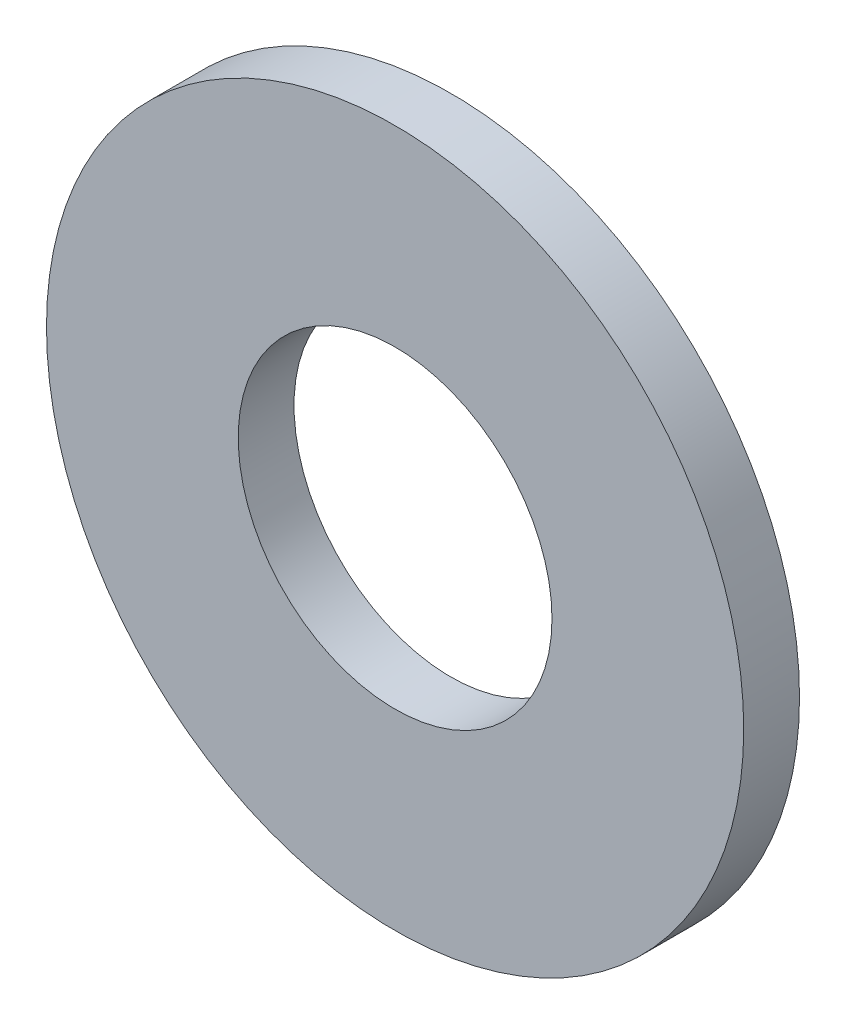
ISO-10303-21;
HEADER;
FILE_DESCRIPTION(('STEP AP214'),'2;1');
FILE_NAME('part.step','',(''),(''),'','','');
FILE_SCHEMA(('AUTOMOTIVE_DESIGN { 1 0 10303 214 1 1 1 1 }'));
ENDSEC;
DATA;
#1=APPLICATION_CONTEXT('core data for automotive mechanical design processes');
#2=APPLICATION_PROTOCOL_DEFINITION('international standard','automotive_design',2000,#1);
#3=PRODUCT_CONTEXT('',#1,'mechanical');
#4=PRODUCT('Part','Part','',(#3));
#5=PRODUCT_RELATED_PRODUCT_CATEGORY('part','',(#4));
#6=PRODUCT_DEFINITION_FORMATION('','',#4);
#7=PRODUCT_DEFINITION_CONTEXT('part definition',#1,'design');
#8=PRODUCT_DEFINITION('design','',#6,#7);
#9=PRODUCT_DEFINITION_SHAPE('','',#8);
#10=(LENGTH_UNIT() NAMED_UNIT(*) SI_UNIT(.MILLI.,.METRE.));
#11=(NAMED_UNIT(*) PLANE_ANGLE_UNIT() SI_UNIT($,.RADIAN.));
#12=(NAMED_UNIT(*) SI_UNIT($,.STERADIAN.) SOLID_ANGLE_UNIT());
#13=UNCERTAINTY_MEASURE_WITH_UNIT(LENGTH_MEASURE(1.E-05),#10,'distance_accuracy_value','');
#14=(GEOMETRIC_REPRESENTATION_CONTEXT(3) GLOBAL_UNCERTAINTY_ASSIGNED_CONTEXT((#13)) GLOBAL_UNIT_ASSIGNED_CONTEXT((#10,
#11,#12)) REPRESENTATION_CONTEXT('',''));
#15=CARTESIAN_POINT('',(0.,0.,0.));
#16=DIRECTION('',(0.,0.,1.));
#17=DIRECTION('',(1.,0.,0.));
#18=AXIS2_PLACEMENT_3D('',#15,#16,#17);
#19=CARTESIAN_POINT('',(0.,0.,-1.27));
#20=DIRECTION('',(0.,0.,1.));
#21=DIRECTION('',(1.,0.,0.));
#22=AXIS2_PLACEMENT_3D('',#19,#20,#21);
#23=CYLINDRICAL_SURFACE('',#22,7.9375);
#24=CARTESIAN_POINT('',(0.,0.,-1.27));
#25=DIRECTION('',(0.,0.,1.));
#26=DIRECTION('',(1.,0.,0.));
#27=AXIS2_PLACEMENT_3D('',#24,#25,#26);
#28=CIRCLE('',#27,7.9375);
#29=CARTESIAN_POINT('',(7.9375,0.,-1.27));
#30=VERTEX_POINT('',#29);
#31=EDGE_CURVE('E10',#30,#30,#28,.T.);
#32=ORIENTED_EDGE('',*,*,#31,.T.);
#33=EDGE_LOOP('',(#32));
#34=FACE_BOUND('',#33,.T.);
#35=CARTESIAN_POINT('',(0.,0.,0.));
#36=DIRECTION('',(0.,0.,1.));
#37=DIRECTION('',(1.,0.,0.));
#38=AXIS2_PLACEMENT_3D('',#35,#36,#37);
#39=CIRCLE('',#38,7.9375);
#40=CARTESIAN_POINT('',(7.9375,0.,0.));
#41=VERTEX_POINT('',#40);
#42=EDGE_CURVE('E33',#41,#41,#39,.T.);
#43=ORIENTED_EDGE('',*,*,#42,.F.);
#44=EDGE_LOOP('',(#43));
#45=FACE_BOUND('',#44,.T.);
#46=ADVANCED_FACE('F30',(#34,#45),#23,.T.);
#47=CARTESIAN_POINT('',(0.,0.,-1.27));
#48=DIRECTION('',(0.,0.,1.));
#49=DIRECTION('',(1.,0.,0.));
#50=AXIS2_PLACEMENT_3D('',#47,#48,#49);
#51=PLANE('',#50);
#52=CARTESIAN_POINT('',(0.,0.,-1.27));
#53=DIRECTION('',(0.,0.,1.));
#54=DIRECTION('',(1.,0.,0.));
#55=AXIS2_PLACEMENT_3D('',#52,#53,#54);
#56=CIRCLE('',#55,3.571875);
#57=CARTESIAN_POINT('',(3.571875,0.,-1.27));
#58=VERTEX_POINT('',#57);
#59=EDGE_CURVE('E40',#58,#58,#56,.T.);
#60=ORIENTED_EDGE('',*,*,#59,.T.);
#61=EDGE_LOOP('',(#60));
#62=FACE_BOUND('',#61,.T.);
#63=ORIENTED_EDGE('',*,*,#31,.F.);
#64=EDGE_LOOP('',(#63));
#65=FACE_BOUND('',#64,.T.);
#66=ADVANCED_FACE('F48',(#62,#65),#51,.F.);
#67=CARTESIAN_POINT('',(0.,0.,0.));
#68=DIRECTION('',(0.,0.,1.));
#69=DIRECTION('',(1.,0.,0.));
#70=AXIS2_PLACEMENT_3D('',#67,#68,#69);
#71=PLANE('',#70);
#72=CARTESIAN_POINT('',(0.,0.,0.));
#73=DIRECTION('',(0.,0.,1.));
#74=DIRECTION('',(1.,0.,0.));
#75=AXIS2_PLACEMENT_3D('',#72,#73,#74);
#76=CIRCLE('',#75,3.571875);
#77=CARTESIAN_POINT('',(3.571875,0.,0.));
#78=VERTEX_POINT('',#77);
#79=EDGE_CURVE('E42',#78,#78,#76,.T.);
#80=ORIENTED_EDGE('',*,*,#79,.F.);
#81=EDGE_LOOP('',(#80));
#82=FACE_BOUND('',#81,.T.);
#83=ORIENTED_EDGE('',*,*,#42,.T.);
#84=EDGE_LOOP('',(#83));
#85=FACE_BOUND('',#84,.T.);
#86=ADVANCED_FACE('F54',(#82,#85),#71,.T.);
#87=CARTESIAN_POINT('',(0.,0.,-1.27));
#88=DIRECTION('',(0.,0.,1.));
#89=DIRECTION('',(1.,0.,0.));
#90=AXIS2_PLACEMENT_3D('',#87,#88,#89);
#91=CYLINDRICAL_SURFACE('',#90,3.571875);
#92=ORIENTED_EDGE('',*,*,#59,.F.);
#93=EDGE_LOOP('',(#92));
#94=FACE_BOUND('',#93,.T.);
#95=ORIENTED_EDGE('',*,*,#79,.T.);
#96=EDGE_LOOP('',(#95));
#97=FACE_BOUND('',#96,.T.);
#98=ADVANCED_FACE('F51',(#94,#97),#91,.F.);
#99=CLOSED_SHELL('',(#46,#66,#86,#98));
#100=MANIFOLD_SOLID_BREP('B2',#99);
#101=ADVANCED_BREP_SHAPE_REPRESENTATION('',(#18,#100),#14);
#102=SHAPE_DEFINITION_REPRESENTATION(#9,#101);
ENDSEC;
END-ISO-10303-21;
